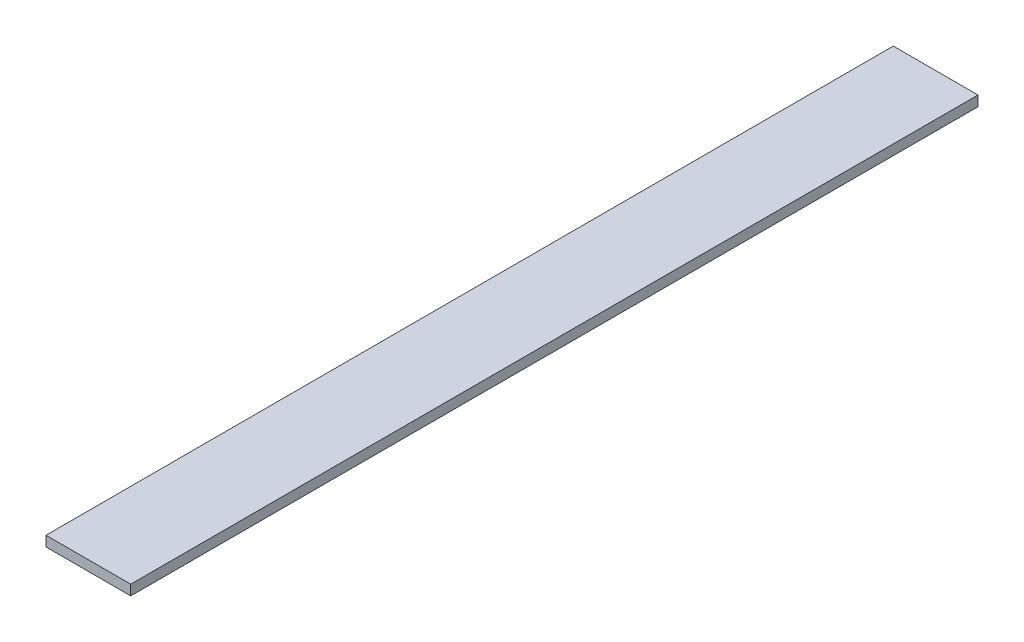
ISO-10303-21;
HEADER;
FILE_DESCRIPTION(('STEP AP214'),'2;1');
FILE_NAME('part.step','',(''),(''),'','','');
FILE_SCHEMA(('AUTOMOTIVE_DESIGN { 1 0 10303 214 1 1 1 1 }'));
ENDSEC;
DATA;
#1=APPLICATION_CONTEXT('core data for automotive mechanical design processes');
#2=APPLICATION_PROTOCOL_DEFINITION('international standard','automotive_design',2000,#1);
#3=PRODUCT_CONTEXT('',#1,'mechanical');
#4=PRODUCT('Part','Part','',(#3));
#5=PRODUCT_RELATED_PRODUCT_CATEGORY('part','',(#4));
#6=PRODUCT_DEFINITION_FORMATION('','',#4);
#7=PRODUCT_DEFINITION_CONTEXT('part definition',#1,'design');
#8=PRODUCT_DEFINITION('design','',#6,#7);
#9=PRODUCT_DEFINITION_SHAPE('','',#8);
#10=(LENGTH_UNIT() NAMED_UNIT(*) SI_UNIT(.MILLI.,.METRE.));
#11=(NAMED_UNIT(*) PLANE_ANGLE_UNIT() SI_UNIT($,.RADIAN.));
#12=(NAMED_UNIT(*) SI_UNIT($,.STERADIAN.) SOLID_ANGLE_UNIT());
#13=UNCERTAINTY_MEASURE_WITH_UNIT(LENGTH_MEASURE(1.E-05),#10,'distance_accuracy_value','');
#14=(GEOMETRIC_REPRESENTATION_CONTEXT(3) GLOBAL_UNCERTAINTY_ASSIGNED_CONTEXT((#13)) GLOBAL_UNIT_ASSIGNED_CONTEXT((#10,
#11,#12)) REPRESENTATION_CONTEXT('',''));
#15=CARTESIAN_POINT('',(0.,0.,0.));
#16=DIRECTION('',(0.,0.,1.));
#17=DIRECTION('',(1.,0.,0.));
#18=AXIS2_PLACEMENT_3D('',#15,#16,#17);
#19=CARTESIAN_POINT('',(25.,0.,0.));
#20=DIRECTION('',(-1.,0.,0.));
#21=DIRECTION('',(0.,0.,1.));
#22=AXIS2_PLACEMENT_3D('',#19,#20,#21);
#23=PLANE('',#22);
#24=DIRECTION('',(0.,-1.,0.));
#25=VECTOR('',#24,1.);
#26=CARTESIAN_POINT('',(25.,3.,0.));
#27=LINE('',#26,#25);
#28=CARTESIAN_POINT('',(25.,6.,0.));
#29=VERTEX_POINT('',#28);
#30=CARTESIAN_POINT('',(25.,0.,0.));
#31=VERTEX_POINT('',#30);
#32=EDGE_CURVE('E51',#29,#31,#27,.T.);
#33=ORIENTED_EDGE('',*,*,#32,.F.);
#34=DIRECTION('',(0.,0.,-1.));
#35=VECTOR('',#34,1.);
#36=CARTESIAN_POINT('',(25.,6.,250.));
#37=LINE('',#36,#35);
#38=CARTESIAN_POINT('',(25.,6.,500.));
#39=VERTEX_POINT('',#38);
#40=EDGE_CURVE('E66',#39,#29,#37,.T.);
#41=ORIENTED_EDGE('',*,*,#40,.F.);
#42=DIRECTION('',(0.,-1.,0.));
#43=VECTOR('',#42,1.);
#44=CARTESIAN_POINT('',(25.,3.,500.));
#45=LINE('',#44,#43);
#46=CARTESIAN_POINT('',(25.,0.,500.));
#47=VERTEX_POINT('',#46);
#48=EDGE_CURVE('E18',#39,#47,#45,.T.);
#49=ORIENTED_EDGE('',*,*,#48,.T.);
#50=DIRECTION('',(0.,0.,1.));
#51=VECTOR('',#50,1.);
#52=CARTESIAN_POINT('',(25.,0.,250.));
#53=LINE('',#52,#51);
#54=EDGE_CURVE('E56',#31,#47,#53,.T.);
#55=ORIENTED_EDGE('',*,*,#54,.F.);
#56=EDGE_LOOP('',(#33,#41,#49,#55));
#57=FACE_BOUND('',#56,.T.);
#58=ADVANCED_FACE('F14',(#57),#23,.F.);
#59=CARTESIAN_POINT('',(25.,0.,500.));
#60=DIRECTION('',(0.,0.,-1.));
#61=DIRECTION('',(-1.,0.,0.));
#62=AXIS2_PLACEMENT_3D('',#59,#60,#61);
#63=PLANE('',#62);
#64=DIRECTION('',(-1.,0.,0.));
#65=VECTOR('',#64,1.);
#66=CARTESIAN_POINT('',(0.,0.,500.));
#67=LINE('',#66,#65);
#68=CARTESIAN_POINT('',(-25.,0.,500.));
#69=VERTEX_POINT('',#68);
#70=EDGE_CURVE('E61',#47,#69,#67,.T.);
#71=ORIENTED_EDGE('',*,*,#70,.F.);
#72=ORIENTED_EDGE('',*,*,#48,.F.);
#73=DIRECTION('',(1.,0.,0.));
#74=VECTOR('',#73,1.);
#75=CARTESIAN_POINT('',(0.,6.,500.));
#76=LINE('',#75,#74);
#77=CARTESIAN_POINT('',(-25.,6.,500.));
#78=VERTEX_POINT('',#77);
#79=EDGE_CURVE('E79',#78,#39,#76,.T.);
#80=ORIENTED_EDGE('',*,*,#79,.F.);
#81=DIRECTION('',(0.,-1.,0.));
#82=VECTOR('',#81,1.);
#83=CARTESIAN_POINT('',(-25.,3.,500.));
#84=LINE('',#83,#82);
#85=EDGE_CURVE('E72',#78,#69,#84,.T.);
#86=ORIENTED_EDGE('',*,*,#85,.T.);
#87=EDGE_LOOP('',(#71,#72,#80,#86));
#88=FACE_BOUND('',#87,.T.);
#89=ADVANCED_FACE('F71',(#88),#63,.F.);
#90=CARTESIAN_POINT('',(-25.,0.,500.));
#91=DIRECTION('',(0.,-1.,0.));
#92=DIRECTION('',(0.,0.,-1.));
#93=AXIS2_PLACEMENT_3D('',#90,#91,#92);
#94=PLANE('',#93);
#95=ORIENTED_EDGE('',*,*,#70,.T.);
#96=DIRECTION('',(0.,0.,-1.));
#97=VECTOR('',#96,1.);
#98=CARTESIAN_POINT('',(-25.,0.,250.));
#99=LINE('',#98,#97);
#100=CARTESIAN_POINT('',(-25.,0.,0.));
#101=VERTEX_POINT('',#100);
#102=EDGE_CURVE('E82',#69,#101,#99,.T.);
#103=ORIENTED_EDGE('',*,*,#102,.T.);
#104=DIRECTION('',(-1.,0.,0.));
#105=VECTOR('',#104,1.);
#106=CARTESIAN_POINT('',(0.,0.,0.));
#107=LINE('',#106,#105);
#108=EDGE_CURVE('E63',#31,#101,#107,.T.);
#109=ORIENTED_EDGE('',*,*,#108,.F.);
#110=ORIENTED_EDGE('',*,*,#54,.T.);
#111=EDGE_LOOP('',(#95,#103,#109,#110));
#112=FACE_BOUND('',#111,.T.);
#113=ADVANCED_FACE('F58',(#112),#94,.T.);
#114=CARTESIAN_POINT('',(25.,0.,0.));
#115=DIRECTION('',(0.,0.,-1.));
#116=DIRECTION('',(-1.,0.,0.));
#117=AXIS2_PLACEMENT_3D('',#114,#115,#116);
#118=PLANE('',#117);
#119=ORIENTED_EDGE('',*,*,#32,.T.);
#120=ORIENTED_EDGE('',*,*,#108,.T.);
#121=DIRECTION('',(0.,1.,0.));
#122=VECTOR('',#121,1.);
#123=CARTESIAN_POINT('',(-25.,3.,0.));
#124=LINE('',#123,#122);
#125=CARTESIAN_POINT('',(-25.,6.,0.));
#126=VERTEX_POINT('',#125);
#127=EDGE_CURVE('E24',#101,#126,#124,.T.);
#128=ORIENTED_EDGE('',*,*,#127,.T.);
#129=DIRECTION('',(-1.,0.,0.));
#130=VECTOR('',#129,1.);
#131=CARTESIAN_POINT('',(0.,6.,0.));
#132=LINE('',#131,#130);
#133=EDGE_CURVE('E32',#29,#126,#132,.T.);
#134=ORIENTED_EDGE('',*,*,#133,.F.);
#135=EDGE_LOOP('',(#119,#120,#128,#134));
#136=FACE_BOUND('',#135,.T.);
#137=ADVANCED_FACE('F86',(#136),#118,.T.);
#138=CARTESIAN_POINT('',(25.,6.,0.));
#139=DIRECTION('',(0.,1.,0.));
#140=DIRECTION('',(-1.,0.,0.));
#141=AXIS2_PLACEMENT_3D('',#138,#139,#140);
#142=PLANE('',#141);
#143=DIRECTION('',(0.,0.,1.));
#144=VECTOR('',#143,1.);
#145=CARTESIAN_POINT('',(-25.,6.,250.));
#146=LINE('',#145,#144);
#147=EDGE_CURVE('E9',#126,#78,#146,.T.);
#148=ORIENTED_EDGE('',*,*,#147,.T.);
#149=ORIENTED_EDGE('',*,*,#79,.T.);
#150=ORIENTED_EDGE('',*,*,#40,.T.);
#151=ORIENTED_EDGE('',*,*,#133,.T.);
#152=EDGE_LOOP('',(#148,#149,#150,#151));
#153=FACE_BOUND('',#152,.T.);
#154=ADVANCED_FACE('F88',(#153),#142,.T.);
#155=CARTESIAN_POINT('',(-25.,0.,500.));
#156=DIRECTION('',(1.,0.,0.));
#157=DIRECTION('',(0.,0.,-1.));
#158=AXIS2_PLACEMENT_3D('',#155,#156,#157);
#159=PLANE('',#158);
#160=ORIENTED_EDGE('',*,*,#127,.F.);
#161=ORIENTED_EDGE('',*,*,#102,.F.);
#162=ORIENTED_EDGE('',*,*,#85,.F.);
#163=ORIENTED_EDGE('',*,*,#147,.F.);
#164=EDGE_LOOP('',(#160,#161,#162,#163));
#165=FACE_BOUND('',#164,.T.);
#166=ADVANCED_FACE('F16',(#165),#159,.F.);
#167=CLOSED_SHELL('',(#58,#89,#113,#137,#154,#166));
#168=MANIFOLD_SOLID_BREP('B1',#167);
#169=ADVANCED_BREP_SHAPE_REPRESENTATION('',(#18,#168),#14);
#170=SHAPE_DEFINITION_REPRESENTATION(#9,#169);
ENDSEC;
END-ISO-10303-21;
